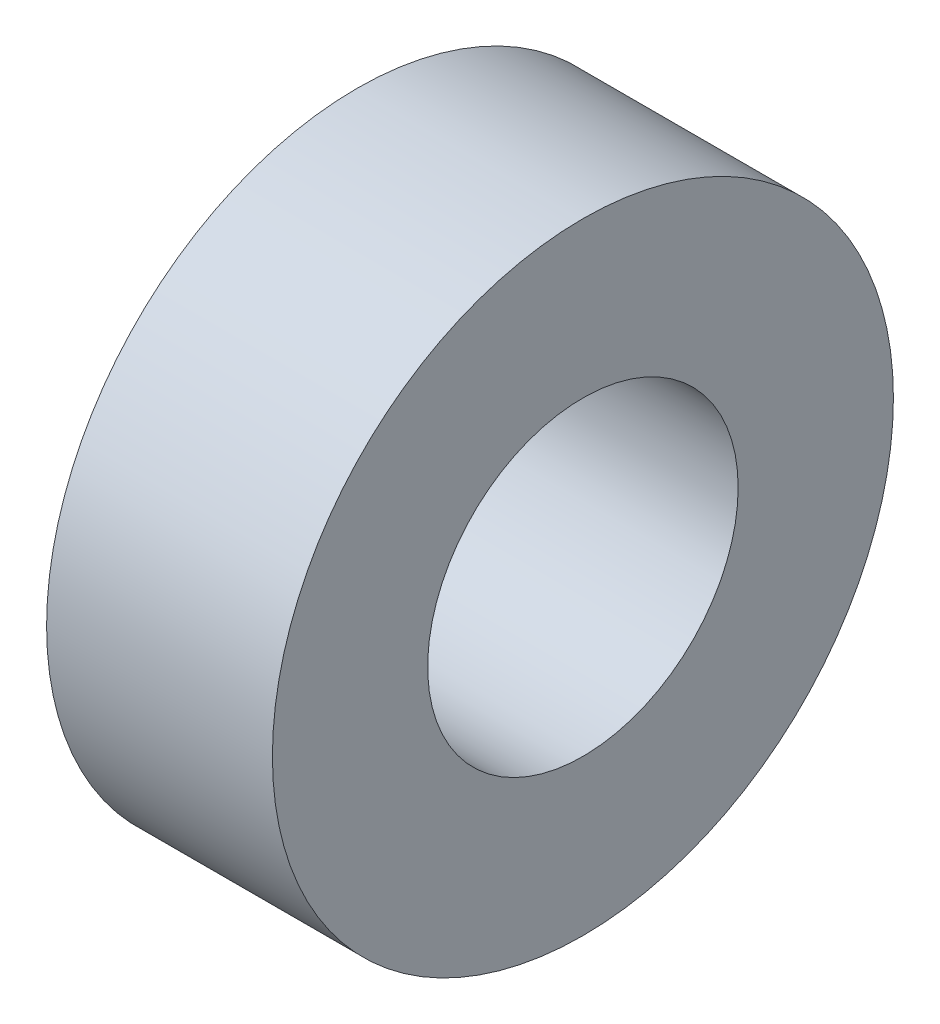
ISO-10303-21;
HEADER;
FILE_DESCRIPTION(('STEP AP214'),'2;1');
FILE_NAME('part.step','',(''),(''),'','','');
FILE_SCHEMA(('AUTOMOTIVE_DESIGN { 1 0 10303 214 1 1 1 1 }'));
ENDSEC;
DATA;
#1=APPLICATION_CONTEXT('core data for automotive mechanical design processes');
#2=APPLICATION_PROTOCOL_DEFINITION('international standard','automotive_design',2000,#1);
#3=PRODUCT_CONTEXT('',#1,'mechanical');
#4=PRODUCT('Part','Part','',(#3));
#5=PRODUCT_RELATED_PRODUCT_CATEGORY('part','',(#4));
#6=PRODUCT_DEFINITION_FORMATION('','',#4);
#7=PRODUCT_DEFINITION_CONTEXT('part definition',#1,'design');
#8=PRODUCT_DEFINITION('design','',#6,#7);
#9=PRODUCT_DEFINITION_SHAPE('','',#8);
#10=(LENGTH_UNIT() NAMED_UNIT(*) SI_UNIT(.MILLI.,.METRE.));
#11=(NAMED_UNIT(*) PLANE_ANGLE_UNIT() SI_UNIT($,.RADIAN.));
#12=(NAMED_UNIT(*) SI_UNIT($,.STERADIAN.) SOLID_ANGLE_UNIT());
#13=UNCERTAINTY_MEASURE_WITH_UNIT(LENGTH_MEASURE(1.E-05),#10,'distance_accuracy_value','');
#14=(GEOMETRIC_REPRESENTATION_CONTEXT(3) GLOBAL_UNCERTAINTY_ASSIGNED_CONTEXT((#13)) GLOBAL_UNIT_ASSIGNED_CONTEXT((#10,
#11,#12)) REPRESENTATION_CONTEXT('',''));
#15=CARTESIAN_POINT('',(0.,0.,0.));
#16=DIRECTION('',(0.,0.,1.));
#17=DIRECTION('',(1.,0.,0.));
#18=AXIS2_PLACEMENT_3D('',#15,#16,#17);
#19=CARTESIAN_POINT('',(0.,0.,0.));
#20=DIRECTION('',(1.,0.,0.));
#21=DIRECTION('',(0.,0.,-1.));
#22=AXIS2_PLACEMENT_3D('',#19,#20,#21);
#23=CYLINDRICAL_SURFACE('',#22,5.5);
#24=CARTESIAN_POINT('',(-33.,0.,0.));
#25=DIRECTION('',(1.,0.,0.));
#26=DIRECTION('',(0.,0.,-1.));
#27=AXIS2_PLACEMENT_3D('',#24,#25,#26);
#28=CIRCLE('',#27,5.5);
#29=CARTESIAN_POINT('',(-33.,0.,-5.5));
#30=VERTEX_POINT('',#29);
#31=EDGE_CURVE('E10',#30,#30,#28,.T.);
#32=ORIENTED_EDGE('',*,*,#31,.T.);
#33=EDGE_LOOP('',(#32));
#34=FACE_BOUND('',#33,.T.);
#35=CARTESIAN_POINT('',(-29.,0.,0.));
#36=DIRECTION('',(1.,0.,0.));
#37=DIRECTION('',(0.,0.,-1.));
#38=AXIS2_PLACEMENT_3D('',#35,#36,#37);
#39=CIRCLE('',#38,5.5);
#40=CARTESIAN_POINT('',(-29.,0.,-5.5));
#41=VERTEX_POINT('',#40);
#42=EDGE_CURVE('E48',#41,#41,#39,.T.);
#43=ORIENTED_EDGE('',*,*,#42,.F.);
#44=EDGE_LOOP('',(#43));
#45=FACE_BOUND('',#44,.T.);
#46=ADVANCED_FACE('F20',(#34,#45),#23,.T.);
#47=CARTESIAN_POINT('',(-33.,5.5,0.));
#48=DIRECTION('',(-1.,0.,0.));
#49=DIRECTION('',(0.,0.,1.));
#50=AXIS2_PLACEMENT_3D('',#47,#48,#49);
#51=PLANE('',#50);
#52=CARTESIAN_POINT('',(-33.,0.,0.));
#53=DIRECTION('',(1.,0.,0.));
#54=DIRECTION('',(0.,0.,-1.));
#55=AXIS2_PLACEMENT_3D('',#52,#53,#54);
#56=CIRCLE('',#55,4.5);
#57=CARTESIAN_POINT('',(-33.,0.,-4.5));
#58=VERTEX_POINT('',#57);
#59=EDGE_CURVE('E26',#58,#58,#56,.T.);
#60=ORIENTED_EDGE('',*,*,#59,.T.);
#61=EDGE_LOOP('',(#60));
#62=FACE_BOUND('',#61,.T.);
#63=ORIENTED_EDGE('',*,*,#31,.F.);
#64=EDGE_LOOP('',(#63));
#65=FACE_BOUND('',#64,.T.);
#66=ADVANCED_FACE('F56',(#62,#65),#51,.T.);
#67=CARTESIAN_POINT('',(0.,0.,0.));
#68=DIRECTION('',(1.,0.,0.));
#69=DIRECTION('',(0.,0.,-1.));
#70=AXIS2_PLACEMENT_3D('',#67,#68,#69);
#71=CYLINDRICAL_SURFACE('',#70,4.5);
#72=CARTESIAN_POINT('',(-31.,0.,0.));
#73=DIRECTION('',(1.,0.,0.));
#74=DIRECTION('',(0.,0.,-1.));
#75=AXIS2_PLACEMENT_3D('',#72,#73,#74);
#76=CIRCLE('',#75,4.5);
#77=CARTESIAN_POINT('',(-31.,0.,-4.5));
#78=VERTEX_POINT('',#77);
#79=EDGE_CURVE('E30',#78,#78,#76,.T.);
#80=ORIENTED_EDGE('',*,*,#79,.T.);
#81=EDGE_LOOP('',(#80));
#82=FACE_BOUND('',#81,.T.);
#83=ORIENTED_EDGE('',*,*,#59,.F.);
#84=EDGE_LOOP('',(#83));
#85=FACE_BOUND('',#84,.T.);
#86=ADVANCED_FACE('F60',(#82,#85),#71,.F.);
#87=CARTESIAN_POINT('',(-31.,4.5,0.));
#88=DIRECTION('',(-1.,0.,0.));
#89=DIRECTION('',(0.,0.,1.));
#90=AXIS2_PLACEMENT_3D('',#87,#88,#89);
#91=PLANE('',#90);
#92=CARTESIAN_POINT('',(-31.,0.,0.));
#93=DIRECTION('',(1.,0.,0.));
#94=DIRECTION('',(0.,0.,-1.));
#95=AXIS2_PLACEMENT_3D('',#92,#93,#94);
#96=CIRCLE('',#95,3.24999999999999);
#97=CARTESIAN_POINT('',(-31.,0.,-3.24999999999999));
#98=VERTEX_POINT('',#97);
#99=EDGE_CURVE('E34',#98,#98,#96,.T.);
#100=ORIENTED_EDGE('',*,*,#99,.T.);
#101=EDGE_LOOP('',(#100));
#102=FACE_BOUND('',#101,.T.);
#103=ORIENTED_EDGE('',*,*,#79,.F.);
#104=EDGE_LOOP('',(#103));
#105=FACE_BOUND('',#104,.T.);
#106=ADVANCED_FACE('F64',(#102,#105),#91,.T.);
#107=CARTESIAN_POINT('',(0.,0.,0.));
#108=DIRECTION('',(1.,0.,0.));
#109=DIRECTION('',(0.,0.,-1.));
#110=AXIS2_PLACEMENT_3D('',#107,#108,#109);
#111=CYLINDRICAL_SURFACE('',#110,3.24999999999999);
#112=CARTESIAN_POINT('',(-33.5,0.,0.));
#113=DIRECTION('',(1.,0.,0.));
#114=DIRECTION('',(0.,0.,-1.));
#115=AXIS2_PLACEMENT_3D('',#112,#113,#114);
#116=CIRCLE('',#115,3.24999999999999);
#117=CARTESIAN_POINT('',(-33.5,0.,-3.24999999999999));
#118=VERTEX_POINT('',#117);
#119=EDGE_CURVE('E39',#118,#118,#116,.T.);
#120=ORIENTED_EDGE('',*,*,#119,.T.);
#121=EDGE_LOOP('',(#120));
#122=FACE_BOUND('',#121,.T.);
#123=ORIENTED_EDGE('',*,*,#99,.F.);
#124=EDGE_LOOP('',(#123));
#125=FACE_BOUND('',#124,.T.);
#126=ADVANCED_FACE('F71',(#122,#125),#111,.T.);
#127=CARTESIAN_POINT('',(-33.5,2.75,0.));
#128=DIRECTION('',(-1.,0.,0.));
#129=DIRECTION('',(0.,0.,1.));
#130=AXIS2_PLACEMENT_3D('',#127,#128,#129);
#131=PLANE('',#130);
#132=CARTESIAN_POINT('',(-33.5,0.,0.));
#133=DIRECTION('',(1.,0.,0.));
#134=DIRECTION('',(0.,0.,-1.));
#135=AXIS2_PLACEMENT_3D('',#132,#133,#134);
#136=CIRCLE('',#135,2.75);
#137=CARTESIAN_POINT('',(-33.5,0.,-2.75));
#138=VERTEX_POINT('',#137);
#139=EDGE_CURVE('E42',#138,#138,#136,.T.);
#140=ORIENTED_EDGE('',*,*,#139,.T.);
#141=EDGE_LOOP('',(#140));
#142=FACE_BOUND('',#141,.T.);
#143=ORIENTED_EDGE('',*,*,#119,.F.);
#144=EDGE_LOOP('',(#143));
#145=FACE_BOUND('',#144,.T.);
#146=ADVANCED_FACE('F75',(#142,#145),#131,.T.);
#147=CARTESIAN_POINT('',(0.,0.,0.));
#148=DIRECTION('',(1.,0.,0.));
#149=DIRECTION('',(0.,0.,-1.));
#150=AXIS2_PLACEMENT_3D('',#147,#148,#149);
#151=CYLINDRICAL_SURFACE('',#150,2.75);
#152=CARTESIAN_POINT('',(-29.,0.,0.));
#153=DIRECTION('',(1.,0.,0.));
#154=DIRECTION('',(0.,0.,-1.));
#155=AXIS2_PLACEMENT_3D('',#152,#153,#154);
#156=CIRCLE('',#155,2.75);
#157=CARTESIAN_POINT('',(-29.,0.,-2.75));
#158=VERTEX_POINT('',#157);
#159=EDGE_CURVE('E45',#158,#158,#156,.T.);
#160=ORIENTED_EDGE('',*,*,#159,.T.);
#161=EDGE_LOOP('',(#160));
#162=FACE_BOUND('',#161,.T.);
#163=ORIENTED_EDGE('',*,*,#139,.F.);
#164=EDGE_LOOP('',(#163));
#165=FACE_BOUND('',#164,.T.);
#166=ADVANCED_FACE('F79',(#162,#165),#151,.F.);
#167=CARTESIAN_POINT('',(-29.,5.5,0.));
#168=DIRECTION('',(1.,0.,0.));
#169=DIRECTION('',(0.,0.,-1.));
#170=AXIS2_PLACEMENT_3D('',#167,#168,#169);
#171=PLANE('',#170);
#172=ORIENTED_EDGE('',*,*,#42,.T.);
#173=EDGE_LOOP('',(#172));
#174=FACE_BOUND('',#173,.T.);
#175=ORIENTED_EDGE('',*,*,#159,.F.);
#176=EDGE_LOOP('',(#175));
#177=FACE_BOUND('',#176,.T.);
#178=ADVANCED_FACE('F52',(#174,#177),#171,.T.);
#179=CLOSED_SHELL('',(#46,#66,#86,#106,#126,#146,#166,#178));
#180=MANIFOLD_SOLID_BREP('B2',#179);
#181=ADVANCED_BREP_SHAPE_REPRESENTATION('',(#18,#180),#14);
#182=SHAPE_DEFINITION_REPRESENTATION(#9,#181);
ENDSEC;
END-ISO-10303-21;
